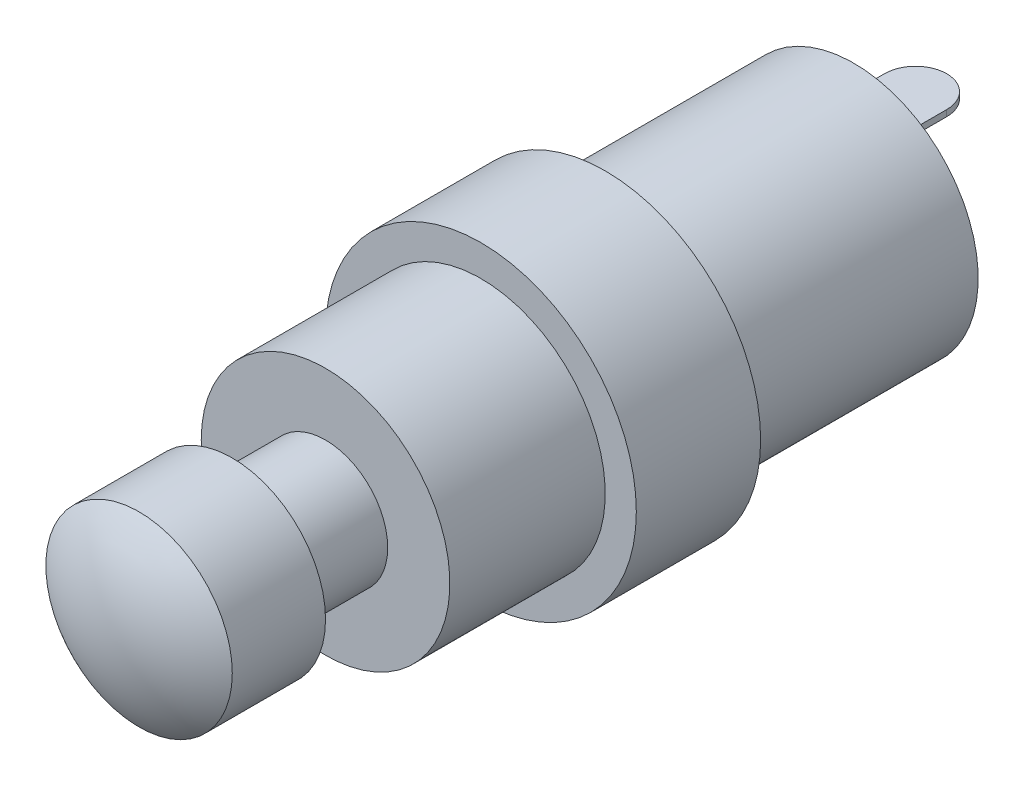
ISO-10303-21;
HEADER;
FILE_DESCRIPTION(('STEP AP214'),'2;1');
FILE_NAME('part.step','',(''),(''),'','','');
FILE_SCHEMA(('AUTOMOTIVE_DESIGN { 1 0 10303 214 1 1 1 1 }'));
ENDSEC;
DATA;
#1=APPLICATION_CONTEXT('core data for automotive mechanical design processes');
#2=APPLICATION_PROTOCOL_DEFINITION('international standard','automotive_design',2000,#1);
#3=PRODUCT_CONTEXT('',#1,'mechanical');
#4=PRODUCT('Part','Part','',(#3));
#5=PRODUCT_RELATED_PRODUCT_CATEGORY('part','',(#4));
#6=PRODUCT_DEFINITION_FORMATION('','',#4);
#7=PRODUCT_DEFINITION_CONTEXT('part definition',#1,'design');
#8=PRODUCT_DEFINITION('design','',#6,#7);
#9=PRODUCT_DEFINITION_SHAPE('','',#8);
#10=(LENGTH_UNIT() NAMED_UNIT(*) SI_UNIT(.MILLI.,.METRE.));
#11=(NAMED_UNIT(*) PLANE_ANGLE_UNIT() SI_UNIT($,.RADIAN.));
#12=(NAMED_UNIT(*) SI_UNIT($,.STERADIAN.) SOLID_ANGLE_UNIT());
#13=UNCERTAINTY_MEASURE_WITH_UNIT(LENGTH_MEASURE(1.E-05),#10,'distance_accuracy_value','');
#14=(GEOMETRIC_REPRESENTATION_CONTEXT(3) GLOBAL_UNCERTAINTY_ASSIGNED_CONTEXT((#13)) GLOBAL_UNIT_ASSIGNED_CONTEXT((#10,
#11,#12)) REPRESENTATION_CONTEXT('',''));
#15=CARTESIAN_POINT('',(0.,0.,0.));
#16=DIRECTION('',(0.,0.,1.));
#17=DIRECTION('',(1.,0.,0.));
#18=AXIS2_PLACEMENT_3D('',#15,#16,#17);
#19=CARTESIAN_POINT('',(0.,0.,-12.));
#20=DIRECTION('',(0.,0.,-1.));
#21=DIRECTION('',(-1.,0.,0.));
#22=AXIS2_PLACEMENT_3D('',#19,#20,#21);
#23=PLANE('',#22);
#24=CARTESIAN_POINT('',(0.,0.,-12.));
#25=DIRECTION('',(0.,0.,-1.));
#26=DIRECTION('',(-1.,0.,0.));
#27=AXIS2_PLACEMENT_3D('',#24,#25,#26);
#28=CIRCLE('',#27,5.);
#29=CARTESIAN_POINT('',(-5.,0.,-12.));
#30=VERTEX_POINT('',#29);
#31=EDGE_CURVE('E154',#30,#30,#28,.T.);
#32=ORIENTED_EDGE('',*,*,#31,.T.);
#33=EDGE_LOOP('',(#32));
#34=FACE_BOUND('',#33,.T.);
#35=CARTESIAN_POINT('',(0.,0.,-12.));
#36=DIRECTION('',(0.,0.,-1.));
#37=DIRECTION('',(-1.,0.,0.));
#38=AXIS2_PLACEMENT_3D('',#35,#36,#37);
#39=CIRCLE('',#38,4.);
#40=CARTESIAN_POINT('',(-4.,0.,-12.));
#41=VERTEX_POINT('',#40);
#42=EDGE_CURVE('E145',#41,#41,#39,.T.);
#43=ORIENTED_EDGE('',*,*,#42,.F.);
#44=EDGE_LOOP('',(#43));
#45=FACE_BOUND('',#44,.T.);
#46=ADVANCED_FACE('F26',(#34,#45),#23,.T.);
#47=CARTESIAN_POINT('',(0.,0.,0.));
#48=DIRECTION('',(0.,0.,1.));
#49=DIRECTION('',(1.,0.,0.));
#50=AXIS2_PLACEMENT_3D('',#47,#48,#49);
#51=PLANE('',#50);
#52=CARTESIAN_POINT('',(0.,0.,0.));
#53=DIRECTION('',(0.,0.,1.));
#54=DIRECTION('',(1.,0.,0.));
#55=AXIS2_PLACEMENT_3D('',#52,#53,#54);
#56=CIRCLE('',#55,3.);
#57=CARTESIAN_POINT('',(3.,0.,0.));
#58=VERTEX_POINT('',#57);
#59=EDGE_CURVE('E166',#58,#58,#56,.T.);
#60=ORIENTED_EDGE('',*,*,#59,.F.);
#61=EDGE_LOOP('',(#60));
#62=FACE_BOUND('',#61,.T.);
#63=CARTESIAN_POINT('',(0.,0.,0.));
#64=DIRECTION('',(0.,0.,1.));
#65=DIRECTION('',(1.,0.,0.));
#66=AXIS2_PLACEMENT_3D('',#63,#64,#65);
#67=CIRCLE('',#66,2.);
#68=CARTESIAN_POINT('',(2.,0.,0.));
#69=VERTEX_POINT('',#68);
#70=EDGE_CURVE('E11',#69,#69,#67,.F.);
#71=ORIENTED_EDGE('',*,*,#70,.F.);
#72=EDGE_LOOP('',(#71));
#73=FACE_BOUND('',#72,.T.);
#74=ADVANCED_FACE('F175',(#62,#73),#51,.F.);
#75=CARTESIAN_POINT('',(0.,0.,3.));
#76=DIRECTION('',(0.,0.,-1.));
#77=DIRECTION('',(-1.,0.,0.));
#78=AXIS2_PLACEMENT_3D('',#75,#76,#77);
#79=CYLINDRICAL_SURFACE('',#78,3.);
#80=CARTESIAN_POINT('',(0.,0.,3.));
#81=DIRECTION('',(0.,0.,1.));
#82=DIRECTION('',(1.,0.,0.));
#83=AXIS2_PLACEMENT_3D('',#80,#81,#82);
#84=CIRCLE('',#83,3.);
#85=CARTESIAN_POINT('',(3.,0.,3.));
#86=VERTEX_POINT('',#85);
#87=EDGE_CURVE('E34',#86,#86,#84,.T.);
#88=ORIENTED_EDGE('',*,*,#87,.F.);
#89=EDGE_LOOP('',(#88));
#90=FACE_BOUND('',#89,.T.);
#91=ORIENTED_EDGE('',*,*,#59,.T.);
#92=EDGE_LOOP('',(#91));
#93=FACE_BOUND('',#92,.T.);
#94=ADVANCED_FACE('F172',(#90,#93),#79,.T.);
#95=CARTESIAN_POINT('',(0.,0.,-0.999999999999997));
#96=DIRECTION('',(0.,0.,1.));
#97=DIRECTION('',(1.,0.,0.));
#98=AXIS2_PLACEMENT_3D('',#95,#96,#97);
#99=SPHERICAL_SURFACE('',#98,5.);
#100=ORIENTED_EDGE('',*,*,#87,.T.);
#101=EDGE_LOOP('',(#100));
#102=FACE_BOUND('',#101,.T.);
#103=ADVANCED_FACE('F28',(#102),#99,.T.);
#104=CARTESIAN_POINT('',(0.,0.,-3.));
#105=DIRECTION('',(0.,0.,1.));
#106=DIRECTION('',(1.,0.,0.));
#107=AXIS2_PLACEMENT_3D('',#104,#105,#106);
#108=CYLINDRICAL_SURFACE('',#107,2.);
#109=CARTESIAN_POINT('',(0.,0.,-3.));
#110=DIRECTION('',(0.,0.,-1.));
#111=DIRECTION('',(-1.,0.,0.));
#112=AXIS2_PLACEMENT_3D('',#109,#110,#111);
#113=CIRCLE('',#112,2.);
#114=CARTESIAN_POINT('',(-2.,0.,-3.));
#115=VERTEX_POINT('',#114);
#116=EDGE_CURVE('E163',#115,#115,#113,.T.);
#117=ORIENTED_EDGE('',*,*,#116,.F.);
#118=EDGE_LOOP('',(#117));
#119=FACE_BOUND('',#118,.T.);
#120=ORIENTED_EDGE('',*,*,#70,.T.);
#121=EDGE_LOOP('',(#120));
#122=FACE_BOUND('',#121,.T.);
#123=ADVANCED_FACE('F183',(#119,#122),#108,.T.);
#124=CARTESIAN_POINT('',(0.,0.,-3.));
#125=DIRECTION('',(0.,0.,-1.));
#126=DIRECTION('',(-1.,0.,0.));
#127=AXIS2_PLACEMENT_3D('',#124,#125,#126);
#128=PLANE('',#127);
#129=CARTESIAN_POINT('',(0.,0.,-3.));
#130=DIRECTION('',(0.,0.,-1.));
#131=DIRECTION('',(-1.,0.,0.));
#132=AXIS2_PLACEMENT_3D('',#129,#130,#131);
#133=CIRCLE('',#132,4.);
#134=CARTESIAN_POINT('',(-4.,0.,-3.));
#135=VERTEX_POINT('',#134);
#136=EDGE_CURVE('E157',#135,#135,#133,.T.);
#137=ORIENTED_EDGE('',*,*,#136,.F.);
#138=EDGE_LOOP('',(#137));
#139=FACE_BOUND('',#138,.T.);
#140=ORIENTED_EDGE('',*,*,#116,.T.);
#141=EDGE_LOOP('',(#140));
#142=FACE_BOUND('',#141,.T.);
#143=ADVANCED_FACE('F185',(#139,#142),#128,.F.);
#144=CARTESIAN_POINT('',(0.,0.,-8.));
#145=DIRECTION('',(0.,0.,1.));
#146=DIRECTION('',(1.,0.,0.));
#147=AXIS2_PLACEMENT_3D('',#144,#145,#146);
#148=CYLINDRICAL_SURFACE('',#147,4.);
#149=CARTESIAN_POINT('',(0.,0.,-8.));
#150=DIRECTION('',(0.,0.,-1.));
#151=DIRECTION('',(-1.,0.,0.));
#152=AXIS2_PLACEMENT_3D('',#149,#150,#151);
#153=CIRCLE('',#152,4.);
#154=CARTESIAN_POINT('',(-4.,0.,-8.));
#155=VERTEX_POINT('',#154);
#156=EDGE_CURVE('E160',#155,#155,#153,.T.);
#157=ORIENTED_EDGE('',*,*,#156,.F.);
#158=EDGE_LOOP('',(#157));
#159=FACE_BOUND('',#158,.T.);
#160=ORIENTED_EDGE('',*,*,#136,.T.);
#161=EDGE_LOOP('',(#160));
#162=FACE_BOUND('',#161,.T.);
#163=ADVANCED_FACE('F191',(#159,#162),#148,.T.);
#164=CARTESIAN_POINT('',(0.,0.,-8.));
#165=DIRECTION('',(0.,0.,-1.));
#166=DIRECTION('',(-1.,0.,0.));
#167=AXIS2_PLACEMENT_3D('',#164,#165,#166);
#168=PLANE('',#167);
#169=CARTESIAN_POINT('',(0.,0.,-8.));
#170=DIRECTION('',(0.,0.,-1.));
#171=DIRECTION('',(-1.,0.,0.));
#172=AXIS2_PLACEMENT_3D('',#169,#170,#171);
#173=CIRCLE('',#172,5.);
#174=CARTESIAN_POINT('',(-5.,0.,-8.));
#175=VERTEX_POINT('',#174);
#176=EDGE_CURVE('E151',#175,#175,#173,.T.);
#177=ORIENTED_EDGE('',*,*,#176,.F.);
#178=EDGE_LOOP('',(#177));
#179=FACE_BOUND('',#178,.T.);
#180=ORIENTED_EDGE('',*,*,#156,.T.);
#181=EDGE_LOOP('',(#180));
#182=FACE_BOUND('',#181,.T.);
#183=ADVANCED_FACE('F207',(#179,#182),#168,.F.);
#184=CARTESIAN_POINT('',(0.,0.,-12.));
#185=DIRECTION('',(0.,0.,1.));
#186=DIRECTION('',(1.,0.,0.));
#187=AXIS2_PLACEMENT_3D('',#184,#185,#186);
#188=CYLINDRICAL_SURFACE('',#187,5.);
#189=ORIENTED_EDGE('',*,*,#31,.F.);
#190=EDGE_LOOP('',(#189));
#191=FACE_BOUND('',#190,.T.);
#192=ORIENTED_EDGE('',*,*,#176,.T.);
#193=EDGE_LOOP('',(#192));
#194=FACE_BOUND('',#193,.T.);
#195=ADVANCED_FACE('F209',(#191,#194),#188,.T.);
#196=CARTESIAN_POINT('',(0.,0.,-20.));
#197=DIRECTION('',(0.,0.,1.));
#198=DIRECTION('',(1.,0.,0.));
#199=AXIS2_PLACEMENT_3D('',#196,#197,#198);
#200=CYLINDRICAL_SURFACE('',#199,4.);
#201=CARTESIAN_POINT('',(0.,0.,-20.));
#202=DIRECTION('',(0.,0.,-1.));
#203=DIRECTION('',(-1.,0.,0.));
#204=AXIS2_PLACEMENT_3D('',#201,#202,#203);
#205=CIRCLE('',#204,4.);
#206=CARTESIAN_POINT('',(-4.,0.,-20.));
#207=VERTEX_POINT('',#206);
#208=EDGE_CURVE('E148',#207,#207,#205,.T.);
#209=ORIENTED_EDGE('',*,*,#208,.F.);
#210=EDGE_LOOP('',(#209));
#211=FACE_BOUND('',#210,.T.);
#212=ORIENTED_EDGE('',*,*,#42,.T.);
#213=EDGE_LOOP('',(#212));
#214=FACE_BOUND('',#213,.T.);
#215=ADVANCED_FACE('F210',(#211,#214),#200,.T.);
#216=CARTESIAN_POINT('',(0.,0.,-20.));
#217=DIRECTION('',(0.,0.,-1.));
#218=DIRECTION('',(-1.,0.,0.));
#219=AXIS2_PLACEMENT_3D('',#216,#217,#218);
#220=PLANE('',#219);
#221=DIRECTION('',(1.,0.,0.));
#222=VECTOR('',#221,1.);
#223=CARTESIAN_POINT('',(-1.01336298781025,2.2,-20.));
#224=LINE('',#223,#222);
#225=CARTESIAN_POINT('',(-1.01336298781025,2.2,-20.));
#226=VERTEX_POINT('',#225);
#227=CARTESIAN_POINT('',(0.986637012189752,2.2,-20.));
#228=VERTEX_POINT('',#227);
#229=EDGE_CURVE('E110',#226,#228,#224,.T.);
#230=ORIENTED_EDGE('',*,*,#229,.F.);
#231=DIRECTION('',(0.,-1.,0.));
#232=VECTOR('',#231,1.);
#233=CARTESIAN_POINT('',(-1.01336298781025,2.2,-20.));
#234=LINE('',#233,#232);
#235=CARTESIAN_POINT('',(-1.01336298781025,2.,-20.));
#236=VERTEX_POINT('',#235);
#237=EDGE_CURVE('E103',#226,#236,#234,.T.);
#238=ORIENTED_EDGE('',*,*,#237,.T.);
#239=DIRECTION('',(1.,0.,0.));
#240=VECTOR('',#239,1.);
#241=CARTESIAN_POINT('',(-1.01336298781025,2.,-20.));
#242=LINE('',#241,#240);
#243=CARTESIAN_POINT('',(0.986637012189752,2.,-20.));
#244=VERTEX_POINT('',#243);
#245=EDGE_CURVE('E90',#236,#244,#242,.T.);
#246=ORIENTED_EDGE('',*,*,#245,.T.);
#247=DIRECTION('',(0.,-1.,0.));
#248=VECTOR('',#247,1.);
#249=CARTESIAN_POINT('',(0.986637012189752,2.2,-20.));
#250=LINE('',#249,#248);
#251=EDGE_CURVE('E112',#228,#244,#250,.T.);
#252=ORIENTED_EDGE('',*,*,#251,.F.);
#253=EDGE_LOOP('',(#230,#238,#246,#252));
#254=FACE_BOUND('',#253,.T.);
#255=DIRECTION('',(1.,0.,0.));
#256=VECTOR('',#255,1.);
#257=CARTESIAN_POINT('',(-1.01336298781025,-1.8,-20.));
#258=LINE('',#257,#256);
#259=CARTESIAN_POINT('',(-1.01336298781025,-1.8,-20.));
#260=VERTEX_POINT('',#259);
#261=CARTESIAN_POINT('',(0.986637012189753,-1.8,-20.));
#262=VERTEX_POINT('',#261);
#263=EDGE_CURVE('E128',#260,#262,#258,.T.);
#264=ORIENTED_EDGE('',*,*,#263,.F.);
#265=DIRECTION('',(0.,-1.,0.));
#266=VECTOR('',#265,1.);
#267=CARTESIAN_POINT('',(-1.01336298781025,-1.8,-20.));
#268=LINE('',#267,#266);
#269=CARTESIAN_POINT('',(-1.01336298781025,-2.,-20.));
#270=VERTEX_POINT('',#269);
#271=EDGE_CURVE('E142',#260,#270,#268,.T.);
#272=ORIENTED_EDGE('',*,*,#271,.T.);
#273=DIRECTION('',(1.,0.,0.));
#274=VECTOR('',#273,1.);
#275=CARTESIAN_POINT('',(-1.01336298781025,-2.,-20.));
#276=LINE('',#275,#274);
#277=CARTESIAN_POINT('',(0.986637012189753,-2.,-20.));
#278=VERTEX_POINT('',#277);
#279=EDGE_CURVE('E115',#270,#278,#276,.T.);
#280=ORIENTED_EDGE('',*,*,#279,.T.);
#281=DIRECTION('',(0.,-1.,0.));
#282=VECTOR('',#281,1.);
#283=CARTESIAN_POINT('',(0.986637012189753,-1.8,-20.));
#284=LINE('',#283,#282);
#285=EDGE_CURVE('E140',#262,#278,#284,.T.);
#286=ORIENTED_EDGE('',*,*,#285,.F.);
#287=EDGE_LOOP('',(#264,#272,#280,#286));
#288=FACE_BOUND('',#287,.T.);
#289=ORIENTED_EDGE('',*,*,#208,.T.);
#290=EDGE_LOOP('',(#289));
#291=FACE_BOUND('',#290,.T.);
#292=ADVANCED_FACE('F108',(#254,#288,#291),#220,.T.);
#293=CARTESIAN_POINT('',(-1.01336298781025,-1.8,-20.));
#294=DIRECTION('',(1.,0.,0.));
#295=DIRECTION('',(0.,0.,-1.));
#296=AXIS2_PLACEMENT_3D('',#293,#294,#295);
#297=PLANE('',#296);
#298=DIRECTION('',(0.,0.,1.));
#299=VECTOR('',#298,1.);
#300=CARTESIAN_POINT('',(-1.01336298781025,-2.,-20.));
#301=LINE('',#300,#299);
#302=CARTESIAN_POINT('',(-1.01336298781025,-2.,-22.));
#303=VERTEX_POINT('',#302);
#304=EDGE_CURVE('E111',#303,#270,#301,.T.);
#305=ORIENTED_EDGE('',*,*,#304,.T.);
#306=ORIENTED_EDGE('',*,*,#271,.F.);
#307=DIRECTION('',(0.,0.,1.));
#308=VECTOR('',#307,1.);
#309=CARTESIAN_POINT('',(-1.01336298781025,-1.8,-20.));
#310=LINE('',#309,#308);
#311=CARTESIAN_POINT('',(-1.01336298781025,-1.8,-22.));
#312=VERTEX_POINT('',#311);
#313=EDGE_CURVE('E126',#312,#260,#310,.T.);
#314=ORIENTED_EDGE('',*,*,#313,.F.);
#315=DIRECTION('',(0.,-1.,0.));
#316=VECTOR('',#315,1.);
#317=CARTESIAN_POINT('',(-1.01336298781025,-1.8,-22.));
#318=LINE('',#317,#316);
#319=EDGE_CURVE('E134',#312,#303,#318,.T.);
#320=ORIENTED_EDGE('',*,*,#319,.T.);
#321=EDGE_LOOP('',(#305,#306,#314,#320));
#322=FACE_BOUND('',#321,.T.);
#323=ADVANCED_FACE('F246',(#322),#297,.F.);
#324=CARTESIAN_POINT('',(0.986637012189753,-1.8,-20.));
#325=DIRECTION('',(-1.,0.,0.));
#326=DIRECTION('',(0.,0.,1.));
#327=AXIS2_PLACEMENT_3D('',#324,#325,#326);
#328=PLANE('',#327);
#329=DIRECTION('',(0.,0.,-1.));
#330=VECTOR('',#329,1.);
#331=CARTESIAN_POINT('',(0.986637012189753,-2.,-20.));
#332=LINE('',#331,#330);
#333=CARTESIAN_POINT('',(0.986637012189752,-2.,-22.));
#334=VERTEX_POINT('',#333);
#335=EDGE_CURVE('E49',#278,#334,#332,.T.);
#336=ORIENTED_EDGE('',*,*,#335,.T.);
#337=DIRECTION('',(0.,-1.,0.));
#338=VECTOR('',#337,1.);
#339=CARTESIAN_POINT('',(0.986637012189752,-1.8,-22.));
#340=LINE('',#339,#338);
#341=CARTESIAN_POINT('',(0.986637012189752,-1.8,-22.));
#342=VERTEX_POINT('',#341);
#343=EDGE_CURVE('E137',#342,#334,#340,.T.);
#344=ORIENTED_EDGE('',*,*,#343,.F.);
#345=DIRECTION('',(0.,0.,-1.));
#346=VECTOR('',#345,1.);
#347=CARTESIAN_POINT('',(0.986637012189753,-1.8,-20.));
#348=LINE('',#347,#346);
#349=EDGE_CURVE('E130',#262,#342,#348,.T.);
#350=ORIENTED_EDGE('',*,*,#349,.F.);
#351=ORIENTED_EDGE('',*,*,#285,.T.);
#352=EDGE_LOOP('',(#336,#344,#350,#351));
#353=FACE_BOUND('',#352,.T.);
#354=ADVANCED_FACE('F254',(#353),#328,.F.);
#355=CARTESIAN_POINT('',(-0.0133629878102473,-1.8,-22.));
#356=DIRECTION('',(0.,-1.,0.));
#357=DIRECTION('',(0.,0.,-1.));
#358=AXIS2_PLACEMENT_3D('',#355,#356,#357);
#359=CYLINDRICAL_SURFACE('',#358,1.);
#360=CARTESIAN_POINT('',(-0.0133629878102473,-2.,-22.));
#361=DIRECTION('',(0.,1.,0.));
#362=DIRECTION('',(0.,0.,1.));
#363=AXIS2_PLACEMENT_3D('',#360,#361,#362);
#364=CIRCLE('',#363,1.);
#365=EDGE_CURVE('E124',#334,#303,#364,.T.);
#366=ORIENTED_EDGE('',*,*,#365,.T.);
#367=ORIENTED_EDGE('',*,*,#319,.F.);
#368=CARTESIAN_POINT('',(-0.0133629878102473,-1.8,-22.));
#369=DIRECTION('',(0.,1.,0.));
#370=DIRECTION('',(0.,0.,1.));
#371=AXIS2_PLACEMENT_3D('',#368,#369,#370);
#372=CIRCLE('',#371,1.);
#373=EDGE_CURVE('E132',#342,#312,#372,.T.);
#374=ORIENTED_EDGE('',*,*,#373,.F.);
#375=ORIENTED_EDGE('',*,*,#343,.T.);
#376=EDGE_LOOP('',(#366,#367,#374,#375));
#377=FACE_BOUND('',#376,.T.);
#378=ADVANCED_FACE('F262',(#377),#359,.T.);
#379=CARTESIAN_POINT('',(-0.0133629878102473,-1.8,-22.));
#380=DIRECTION('',(0.,1.,0.));
#381=DIRECTION('',(0.,0.,1.));
#382=AXIS2_PLACEMENT_3D('',#379,#380,#381);
#383=PLANE('',#382);
#384=ORIENTED_EDGE('',*,*,#313,.T.);
#385=ORIENTED_EDGE('',*,*,#263,.T.);
#386=ORIENTED_EDGE('',*,*,#349,.T.);
#387=ORIENTED_EDGE('',*,*,#373,.T.);
#388=EDGE_LOOP('',(#384,#385,#386,#387));
#389=FACE_BOUND('',#388,.T.);
#390=ADVANCED_FACE('F270',(#389),#383,.T.);
#391=CARTESIAN_POINT('',(-0.0133629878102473,-2.,-22.));
#392=DIRECTION('',(0.,1.,0.));
#393=DIRECTION('',(0.,0.,1.));
#394=AXIS2_PLACEMENT_3D('',#391,#392,#393);
#395=PLANE('',#394);
#396=ORIENTED_EDGE('',*,*,#304,.F.);
#397=ORIENTED_EDGE('',*,*,#365,.F.);
#398=ORIENTED_EDGE('',*,*,#335,.F.);
#399=ORIENTED_EDGE('',*,*,#279,.F.);
#400=EDGE_LOOP('',(#396,#397,#398,#399));
#401=FACE_BOUND('',#400,.T.);
#402=ADVANCED_FACE('F278',(#401),#395,.F.);
#403=CARTESIAN_POINT('',(-1.01336298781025,2.2,-20.));
#404=DIRECTION('',(1.,0.,0.));
#405=DIRECTION('',(0.,0.,-1.));
#406=AXIS2_PLACEMENT_3D('',#403,#404,#405);
#407=PLANE('',#406);
#408=DIRECTION('',(0.,0.,1.));
#409=VECTOR('',#408,1.);
#410=CARTESIAN_POINT('',(-1.01336298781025,2.,-20.));
#411=LINE('',#410,#409);
#412=CARTESIAN_POINT('',(-1.01336298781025,2.,-22.));
#413=VERTEX_POINT('',#412);
#414=EDGE_CURVE('E93',#413,#236,#411,.T.);
#415=ORIENTED_EDGE('',*,*,#414,.T.);
#416=ORIENTED_EDGE('',*,*,#237,.F.);
#417=DIRECTION('',(0.,0.,1.));
#418=VECTOR('',#417,1.);
#419=CARTESIAN_POINT('',(-1.01336298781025,2.2,-20.));
#420=LINE('',#419,#418);
#421=CARTESIAN_POINT('',(-1.01336298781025,2.2,-22.));
#422=VERTEX_POINT('',#421);
#423=EDGE_CURVE('E321',#422,#226,#420,.T.);
#424=ORIENTED_EDGE('',*,*,#423,.F.);
#425=DIRECTION('',(0.,-1.,0.));
#426=VECTOR('',#425,1.);
#427=CARTESIAN_POINT('',(-1.01336298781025,2.2,-22.));
#428=LINE('',#427,#426);
#429=EDGE_CURVE('E106',#422,#413,#428,.T.);
#430=ORIENTED_EDGE('',*,*,#429,.T.);
#431=EDGE_LOOP('',(#415,#416,#424,#430));
#432=FACE_BOUND('',#431,.T.);
#433=ADVANCED_FACE('F101',(#432),#407,.F.);
#434=CARTESIAN_POINT('',(0.986637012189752,2.2,-20.));
#435=DIRECTION('',(-1.,0.,0.));
#436=DIRECTION('',(0.,0.,1.));
#437=AXIS2_PLACEMENT_3D('',#434,#435,#436);
#438=PLANE('',#437);
#439=DIRECTION('',(0.,0.,-1.));
#440=VECTOR('',#439,1.);
#441=CARTESIAN_POINT('',(0.986637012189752,2.,-20.));
#442=LINE('',#441,#440);
#443=CARTESIAN_POINT('',(0.986637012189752,2.,-22.));
#444=VERTEX_POINT('',#443);
#445=EDGE_CURVE('E41',#244,#444,#442,.T.);
#446=ORIENTED_EDGE('',*,*,#445,.T.);
#447=DIRECTION('',(0.,-1.,0.));
#448=VECTOR('',#447,1.);
#449=CARTESIAN_POINT('',(0.986637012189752,2.2,-22.));
#450=LINE('',#449,#448);
#451=CARTESIAN_POINT('',(0.986637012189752,2.2,-22.));
#452=VERTEX_POINT('',#451);
#453=EDGE_CURVE('E117',#452,#444,#450,.T.);
#454=ORIENTED_EDGE('',*,*,#453,.F.);
#455=DIRECTION('',(0.,0.,-1.));
#456=VECTOR('',#455,1.);
#457=CARTESIAN_POINT('',(0.986637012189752,2.2,-20.));
#458=LINE('',#457,#456);
#459=EDGE_CURVE('E327',#228,#452,#458,.T.);
#460=ORIENTED_EDGE('',*,*,#459,.F.);
#461=ORIENTED_EDGE('',*,*,#251,.T.);
#462=EDGE_LOOP('',(#446,#454,#460,#461));
#463=FACE_BOUND('',#462,.T.);
#464=ADVANCED_FACE('F290',(#463),#438,.F.);
#465=CARTESIAN_POINT('',(-0.0133629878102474,2.2,-22.));
#466=DIRECTION('',(0.,-1.,0.));
#467=DIRECTION('',(0.,0.,-1.));
#468=AXIS2_PLACEMENT_3D('',#465,#466,#467);
#469=CYLINDRICAL_SURFACE('',#468,1.);
#470=CARTESIAN_POINT('',(-0.0133629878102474,2.,-22.));
#471=DIRECTION('',(0.,1.,0.));
#472=DIRECTION('',(0.,0.,1.));
#473=AXIS2_PLACEMENT_3D('',#470,#471,#472);
#474=CIRCLE('',#473,1.);
#475=EDGE_CURVE('E325',#444,#413,#474,.T.);
#476=ORIENTED_EDGE('',*,*,#475,.T.);
#477=ORIENTED_EDGE('',*,*,#429,.F.);
#478=CARTESIAN_POINT('',(-0.0133629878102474,2.2,-22.));
#479=DIRECTION('',(0.,1.,0.));
#480=DIRECTION('',(0.,0.,1.));
#481=AXIS2_PLACEMENT_3D('',#478,#479,#480);
#482=CIRCLE('',#481,1.);
#483=EDGE_CURVE('E324',#452,#422,#482,.T.);
#484=ORIENTED_EDGE('',*,*,#483,.F.);
#485=ORIENTED_EDGE('',*,*,#453,.T.);
#486=EDGE_LOOP('',(#476,#477,#484,#485));
#487=FACE_BOUND('',#486,.T.);
#488=ADVANCED_FACE('F297',(#487),#469,.T.);
#489=CARTESIAN_POINT('',(-0.0133629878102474,2.2,-22.));
#490=DIRECTION('',(0.,1.,0.));
#491=DIRECTION('',(0.,0.,1.));
#492=AXIS2_PLACEMENT_3D('',#489,#490,#491);
#493=PLANE('',#492);
#494=ORIENTED_EDGE('',*,*,#423,.T.);
#495=ORIENTED_EDGE('',*,*,#229,.T.);
#496=ORIENTED_EDGE('',*,*,#459,.T.);
#497=ORIENTED_EDGE('',*,*,#483,.T.);
#498=EDGE_LOOP('',(#494,#495,#496,#497));
#499=FACE_BOUND('',#498,.T.);
#500=ADVANCED_FACE('F305',(#499),#493,.T.);
#501=CARTESIAN_POINT('',(-0.0133629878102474,2.,-22.));
#502=DIRECTION('',(0.,1.,0.));
#503=DIRECTION('',(0.,0.,1.));
#504=AXIS2_PLACEMENT_3D('',#501,#502,#503);
#505=PLANE('',#504);
#506=ORIENTED_EDGE('',*,*,#414,.F.);
#507=ORIENTED_EDGE('',*,*,#475,.F.);
#508=ORIENTED_EDGE('',*,*,#445,.F.);
#509=ORIENTED_EDGE('',*,*,#245,.F.);
#510=EDGE_LOOP('',(#506,#507,#508,#509));
#511=FACE_BOUND('',#510,.T.);
#512=ADVANCED_FACE('F92',(#511),#505,.F.);
#513=CLOSED_SHELL('',(#46,#74,#94,#103,#123,#143,#163,#183,#195,#215,#292,#323,#354,#378,#390,
#402,#433,#464,#488,#500,#512));
#514=MANIFOLD_SOLID_BREP('B2',#513);
#515=ADVANCED_BREP_SHAPE_REPRESENTATION('',(#18,#514),#14);
#516=SHAPE_DEFINITION_REPRESENTATION(#9,#515);
ENDSEC;
END-ISO-10303-21;
